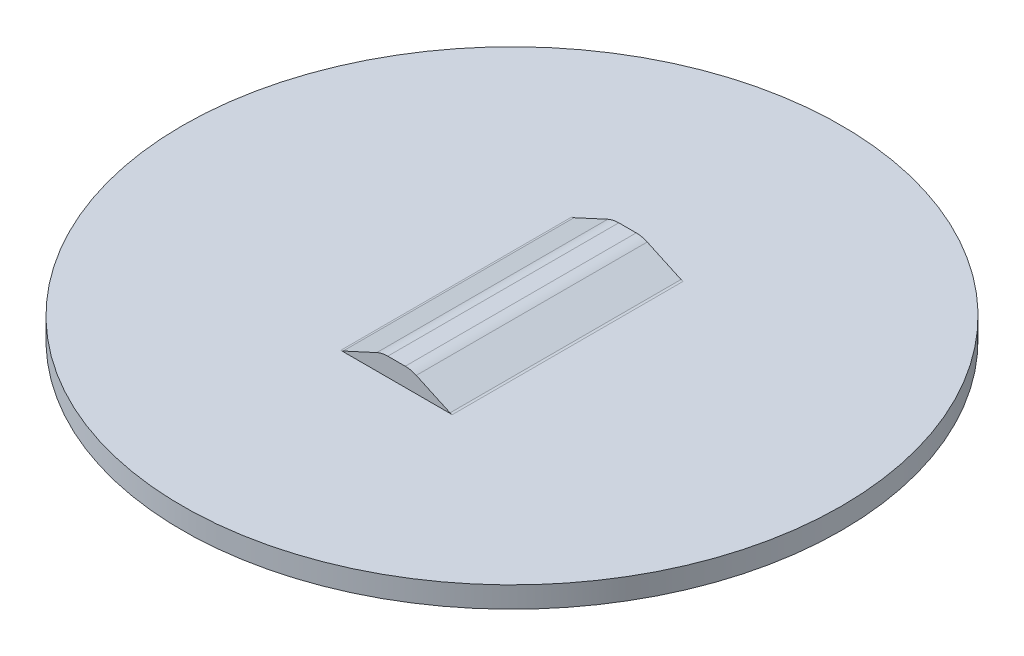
ISO-10303-21;
HEADER;
FILE_DESCRIPTION(('STEP AP214'),'2;1');
FILE_NAME('part.step','',(''),(''),'','','');
FILE_SCHEMA(('AUTOMOTIVE_DESIGN { 1 0 10303 214 1 1 1 1 }'));
ENDSEC;
DATA;
#1=APPLICATION_CONTEXT('core data for automotive mechanical design processes');
#2=APPLICATION_PROTOCOL_DEFINITION('international standard','automotive_design',2000,#1);
#3=PRODUCT_CONTEXT('',#1,'mechanical');
#4=PRODUCT('Part','Part','',(#3));
#5=PRODUCT_RELATED_PRODUCT_CATEGORY('part','',(#4));
#6=PRODUCT_DEFINITION_FORMATION('','',#4);
#7=PRODUCT_DEFINITION_CONTEXT('part definition',#1,'design');
#8=PRODUCT_DEFINITION('design','',#6,#7);
#9=PRODUCT_DEFINITION_SHAPE('','',#8);
#10=(LENGTH_UNIT() NAMED_UNIT(*) SI_UNIT(.MILLI.,.METRE.));
#11=(NAMED_UNIT(*) PLANE_ANGLE_UNIT() SI_UNIT($,.RADIAN.));
#12=(NAMED_UNIT(*) SI_UNIT($,.STERADIAN.) SOLID_ANGLE_UNIT());
#13=UNCERTAINTY_MEASURE_WITH_UNIT(LENGTH_MEASURE(1.E-05),#10,'distance_accuracy_value','');
#14=(GEOMETRIC_REPRESENTATION_CONTEXT(3) GLOBAL_UNCERTAINTY_ASSIGNED_CONTEXT((#13)) GLOBAL_UNIT_ASSIGNED_CONTEXT((#10,
#11,#12)) REPRESENTATION_CONTEXT('',''));
#15=CARTESIAN_POINT('',(0.,0.,0.));
#16=DIRECTION('',(0.,0.,1.));
#17=DIRECTION('',(1.,0.,0.));
#18=AXIS2_PLACEMENT_3D('',#15,#16,#17);
#19=CARTESIAN_POINT('',(0.420116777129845,-0.381,11.1252));
#20=DIRECTION('',(0.,0.,-1.));
#21=DIRECTION('',(-1.,0.,0.));
#22=AXIS2_PLACEMENT_3D('',#19,#20,#21);
#23=CYLINDRICAL_SURFACE('',#22,1.27);
#24=CARTESIAN_POINT('',(0.420116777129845,-0.381,11.1252));
#25=DIRECTION('',(0.,0.,-1.));
#26=DIRECTION('',(-1.,0.,0.));
#27=AXIS2_PLACEMENT_3D('',#24,#25,#26);
#28=CIRCLE('',#27,1.27);
#29=CARTESIAN_POINT('',(0.951357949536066,0.772552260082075,11.1252));
#30=VERTEX_POINT('',#29);
#31=CARTESIAN_POINT('',(0.420116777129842,0.889,11.1252));
#32=VERTEX_POINT('',#31);
#33=EDGE_CURVE('E198',#30,#32,#28,.F.);
#34=ORIENTED_EDGE('',*,*,#33,.F.);
#35=DIRECTION('',(0.,0.,1.));
#36=VECTOR('',#35,1.);
#37=CARTESIAN_POINT('',(0.951357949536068,0.772552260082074,11.1252));
#38=LINE('',#37,#36);
#39=CARTESIAN_POINT('',(0.951357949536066,0.772552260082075,0.));
#40=VERTEX_POINT('',#39);
#41=EDGE_CURVE('E113',#30,#40,#38,.F.);
#42=ORIENTED_EDGE('',*,*,#41,.T.);
#43=CARTESIAN_POINT('',(0.420116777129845,-0.381,0.));
#44=DIRECTION('',(0.,0.,-1.));
#45=DIRECTION('',(-1.,0.,0.));
#46=AXIS2_PLACEMENT_3D('',#43,#44,#45);
#47=CIRCLE('',#46,1.27);
#48=CARTESIAN_POINT('',(0.420116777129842,0.889,0.));
#49=VERTEX_POINT('',#48);
#50=EDGE_CURVE('E21',#40,#49,#47,.F.);
#51=ORIENTED_EDGE('',*,*,#50,.T.);
#52=DIRECTION('',(0.,0.,1.));
#53=VECTOR('',#52,1.);
#54=CARTESIAN_POINT('',(0.420116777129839,0.889,11.1252));
#55=LINE('',#54,#53);
#56=EDGE_CURVE('E117',#49,#32,#55,.T.);
#57=ORIENTED_EDGE('',*,*,#56,.T.);
#58=EDGE_LOOP('',(#34,#42,#51,#57));
#59=FACE_BOUND('',#58,.T.);
#60=ADVANCED_FACE('F18',(#59),#23,.T.);
#61=CARTESIAN_POINT('',(-0.42011677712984,0.889,11.1252));
#62=DIRECTION('',(0.,-1.,0.));
#63=DIRECTION('',(1.,0.,0.));
#64=AXIS2_PLACEMENT_3D('',#61,#62,#63);
#65=PLANE('',#64);
#66=DIRECTION('',(0.,0.,-1.));
#67=VECTOR('',#66,1.);
#68=CARTESIAN_POINT('',(-0.42011677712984,0.889,11.1252));
#69=LINE('',#68,#67);
#70=CARTESIAN_POINT('',(-0.420116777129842,0.889,11.1252));
#71=VERTEX_POINT('',#70);
#72=CARTESIAN_POINT('',(-0.420116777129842,0.889,0.));
#73=VERTEX_POINT('',#72);
#74=EDGE_CURVE('E130',#71,#73,#69,.T.);
#75=ORIENTED_EDGE('',*,*,#74,.F.);
#76=DIRECTION('',(1.,0.,0.));
#77=VECTOR('',#76,1.);
#78=CARTESIAN_POINT('',(-0.951357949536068,0.889,11.1252));
#79=LINE('',#78,#77);
#80=EDGE_CURVE('E128',#32,#71,#79,.F.);
#81=ORIENTED_EDGE('',*,*,#80,.F.);
#82=ORIENTED_EDGE('',*,*,#56,.F.);
#83=DIRECTION('',(1.,0.,0.));
#84=VECTOR('',#83,1.);
#85=CARTESIAN_POINT('',(-2.68457664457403,0.889,0.));
#86=LINE('',#85,#84);
#87=EDGE_CURVE('E122',#49,#73,#86,.F.);
#88=ORIENTED_EDGE('',*,*,#87,.T.);
#89=EDGE_LOOP('',(#75,#81,#82,#88));
#90=FACE_BOUND('',#89,.T.);
#91=ADVANCED_FACE('F125',(#90),#65,.F.);
#92=CARTESIAN_POINT('',(-0.420116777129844,-0.381,11.1252));
#93=DIRECTION('',(0.,0.,-1.));
#94=DIRECTION('',(-1.,0.,0.));
#95=AXIS2_PLACEMENT_3D('',#92,#93,#94);
#96=CYLINDRICAL_SURFACE('',#95,1.27);
#97=CARTESIAN_POINT('',(-0.420116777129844,-0.381,11.1252));
#98=DIRECTION('',(0.,0.,-1.));
#99=DIRECTION('',(-1.,0.,0.));
#100=AXIS2_PLACEMENT_3D('',#97,#98,#99);
#101=CIRCLE('',#100,1.27);
#102=CARTESIAN_POINT('',(-0.951357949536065,0.772552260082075,11.1252));
#103=VERTEX_POINT('',#102);
#104=EDGE_CURVE('E195',#71,#103,#101,.F.);
#105=ORIENTED_EDGE('',*,*,#104,.F.);
#106=ORIENTED_EDGE('',*,*,#74,.T.);
#107=CARTESIAN_POINT('',(-0.420116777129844,-0.381,0.));
#108=DIRECTION('',(0.,0.,-1.));
#109=DIRECTION('',(-1.,0.,0.));
#110=AXIS2_PLACEMENT_3D('',#107,#108,#109);
#111=CIRCLE('',#110,1.27);
#112=CARTESIAN_POINT('',(-0.951357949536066,0.772552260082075,0.));
#113=VERTEX_POINT('',#112);
#114=EDGE_CURVE('E136',#73,#113,#111,.F.);
#115=ORIENTED_EDGE('',*,*,#114,.T.);
#116=DIRECTION('',(0.,0.,1.));
#117=VECTOR('',#116,1.);
#118=CARTESIAN_POINT('',(-0.951357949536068,0.772552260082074,11.1252));
#119=LINE('',#118,#117);
#120=EDGE_CURVE('E150',#113,#103,#119,.T.);
#121=ORIENTED_EDGE('',*,*,#120,.T.);
#122=EDGE_LOOP('',(#105,#106,#115,#121));
#123=FACE_BOUND('',#122,.T.);
#124=ADVANCED_FACE('F266',(#123),#96,.T.);
#125=CARTESIAN_POINT('',(-0.951357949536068,0.772552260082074,11.1252));
#126=DIRECTION('',(0.418300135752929,-0.908308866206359,0.));
#127=DIRECTION('',(0.908308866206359,0.418300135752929,0.));
#128=AXIS2_PLACEMENT_3D('',#125,#126,#127);
#129=PLANE('',#128);
#130=DIRECTION('',(0.,0.,-1.));
#131=VECTOR('',#130,1.);
#132=CARTESIAN_POINT('',(-2.57832841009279,0.0232895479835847,11.1252));
#133=LINE('',#132,#131);
#134=CARTESIAN_POINT('',(-2.57832841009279,0.0232895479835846,0.));
#135=VERTEX_POINT('',#134);
#136=CARTESIAN_POINT('',(-2.57832841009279,0.0232895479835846,11.1252));
#137=VERTEX_POINT('',#136);
#138=EDGE_CURVE('E147',#135,#137,#133,.F.);
#139=ORIENTED_EDGE('',*,*,#138,.T.);
#140=DIRECTION('',(-0.908308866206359,-0.418300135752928,0.));
#141=VECTOR('',#140,1.);
#142=CARTESIAN_POINT('',(-0.951357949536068,0.772552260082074,11.1252));
#143=LINE('',#142,#141);
#144=EDGE_CURVE('E194',#103,#137,#143,.T.);
#145=ORIENTED_EDGE('',*,*,#144,.F.);
#146=ORIENTED_EDGE('',*,*,#120,.F.);
#147=DIRECTION('',(-0.908308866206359,-0.418300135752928,0.));
#148=VECTOR('',#147,1.);
#149=CARTESIAN_POINT('',(-0.951357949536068,0.772552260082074,0.));
#150=LINE('',#149,#148);
#151=EDGE_CURVE('E138',#113,#135,#150,.T.);
#152=ORIENTED_EDGE('',*,*,#151,.T.);
#153=EDGE_LOOP('',(#139,#145,#146,#152));
#154=FACE_BOUND('',#153,.T.);
#155=ADVANCED_FACE('F244',(#154),#129,.F.);
#156=CARTESIAN_POINT('',(0.951357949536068,0.772552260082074,11.1252));
#157=DIRECTION('',(-0.418300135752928,-0.908308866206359,0.));
#158=DIRECTION('',(0.908308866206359,-0.418300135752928,0.));
#159=AXIS2_PLACEMENT_3D('',#156,#157,#158);
#160=PLANE('',#159);
#161=ORIENTED_EDGE('',*,*,#41,.F.);
#162=DIRECTION('',(-0.908308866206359,0.418300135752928,0.));
#163=VECTOR('',#162,1.);
#164=CARTESIAN_POINT('',(2.57832841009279,0.0232895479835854,11.1252));
#165=LINE('',#164,#163);
#166=CARTESIAN_POINT('',(2.57832841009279,0.0232895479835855,11.1252));
#167=VERTEX_POINT('',#166);
#168=EDGE_CURVE('E200',#167,#30,#165,.T.);
#169=ORIENTED_EDGE('',*,*,#168,.F.);
#170=DIRECTION('',(0.,0.,-1.));
#171=VECTOR('',#170,1.);
#172=CARTESIAN_POINT('',(2.57832841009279,0.0232895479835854,11.1252));
#173=LINE('',#172,#171);
#174=CARTESIAN_POINT('',(2.57832841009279,0.0232895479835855,0.));
#175=VERTEX_POINT('',#174);
#176=EDGE_CURVE('E143',#167,#175,#173,.T.);
#177=ORIENTED_EDGE('',*,*,#176,.T.);
#178=DIRECTION('',(-0.908308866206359,0.418300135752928,0.));
#179=VECTOR('',#178,1.);
#180=CARTESIAN_POINT('',(2.57832841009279,0.0232895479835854,0.));
#181=LINE('',#180,#179);
#182=EDGE_CURVE('E123',#175,#40,#181,.T.);
#183=ORIENTED_EDGE('',*,*,#182,.T.);
#184=EDGE_LOOP('',(#161,#169,#177,#183));
#185=FACE_BOUND('',#184,.T.);
#186=ADVANCED_FACE('F257',(#185),#160,.F.);
#187=CARTESIAN_POINT('',(-2.68457664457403,0.253999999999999,0.));
#188=DIRECTION('',(0.,0.,1.));
#189=DIRECTION('',(1.,0.,0.));
#190=AXIS2_PLACEMENT_3D('',#187,#188,#189);
#191=PLANE('',#190);
#192=CARTESIAN_POINT('',(-2.68457664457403,0.253999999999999,0.));
#193=DIRECTION('',(0.,0.,-1.));
#194=DIRECTION('',(-1.,0.,0.));
#195=AXIS2_PLACEMENT_3D('',#192,#193,#194);
#196=CIRCLE('',#195,0.253999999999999);
#197=CARTESIAN_POINT('',(-2.68457664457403,0.,0.));
#198=VERTEX_POINT('',#197);
#199=EDGE_CURVE('E149',#198,#135,#196,.F.);
#200=ORIENTED_EDGE('',*,*,#199,.T.);
#201=ORIENTED_EDGE('',*,*,#151,.F.);
#202=ORIENTED_EDGE('',*,*,#114,.F.);
#203=ORIENTED_EDGE('',*,*,#87,.F.);
#204=ORIENTED_EDGE('',*,*,#50,.F.);
#205=ORIENTED_EDGE('',*,*,#182,.F.);
#206=CARTESIAN_POINT('',(2.68457664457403,0.254000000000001,0.));
#207=DIRECTION('',(0.,0.,-1.));
#208=DIRECTION('',(-1.,0.,0.));
#209=AXIS2_PLACEMENT_3D('',#206,#207,#208);
#210=CIRCLE('',#209,0.254);
#211=CARTESIAN_POINT('',(2.68457664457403,0.,0.));
#212=VERTEX_POINT('',#211);
#213=EDGE_CURVE('E145',#175,#212,#210,.F.);
#214=ORIENTED_EDGE('',*,*,#213,.T.);
#215=DIRECTION('',(1.,0.,0.));
#216=VECTOR('',#215,1.);
#217=CARTESIAN_POINT('',(2.68457664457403,0.,0.));
#218=LINE('',#217,#216);
#219=EDGE_CURVE('E212',#212,#198,#218,.F.);
#220=ORIENTED_EDGE('',*,*,#219,.T.);
#221=EDGE_LOOP('',(#200,#201,#202,#203,#204,#205,#214,#220));
#222=FACE_BOUND('',#221,.T.);
#223=ADVANCED_FACE('F134',(#222),#191,.F.);
#224=CARTESIAN_POINT('',(-2.68457664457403,0.253999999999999,11.1252));
#225=DIRECTION('',(0.,0.,-1.));
#226=DIRECTION('',(-1.,0.,0.));
#227=AXIS2_PLACEMENT_3D('',#224,#225,#226);
#228=CYLINDRICAL_SURFACE('',#227,0.253999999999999);
#229=DIRECTION('',(0.,0.,1.));
#230=VECTOR('',#229,1.);
#231=CARTESIAN_POINT('',(-2.68457664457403,0.,11.1252));
#232=LINE('',#231,#230);
#233=CARTESIAN_POINT('',(-2.68457664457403,0.,11.1252));
#234=VERTEX_POINT('',#233);
#235=EDGE_CURVE('E209',#198,#234,#232,.T.);
#236=ORIENTED_EDGE('',*,*,#235,.T.);
#237=CARTESIAN_POINT('',(-2.68457664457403,0.253999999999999,11.1252));
#238=DIRECTION('',(0.,0.,-1.));
#239=DIRECTION('',(-1.,0.,0.));
#240=AXIS2_PLACEMENT_3D('',#237,#238,#239);
#241=CIRCLE('',#240,0.253999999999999);
#242=EDGE_CURVE('E191',#137,#234,#241,.T.);
#243=ORIENTED_EDGE('',*,*,#242,.F.);
#244=ORIENTED_EDGE('',*,*,#138,.F.);
#245=ORIENTED_EDGE('',*,*,#199,.F.);
#246=EDGE_LOOP('',(#236,#243,#244,#245));
#247=FACE_BOUND('',#246,.T.);
#248=ADVANCED_FACE('F246',(#247),#228,.F.);
#249=CARTESIAN_POINT('',(-0.951357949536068,0.772552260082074,11.1252));
#250=DIRECTION('',(0.,0.,1.));
#251=DIRECTION('',(1.,0.,0.));
#252=AXIS2_PLACEMENT_3D('',#249,#250,#251);
#253=PLANE('',#252);
#254=ORIENTED_EDGE('',*,*,#144,.T.);
#255=ORIENTED_EDGE('',*,*,#242,.T.);
#256=DIRECTION('',(1.,0.,0.));
#257=VECTOR('',#256,1.);
#258=CARTESIAN_POINT('',(2.68457664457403,0.,11.1252));
#259=LINE('',#258,#257);
#260=CARTESIAN_POINT('',(2.68457664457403,0.,11.1252));
#261=VERTEX_POINT('',#260);
#262=EDGE_CURVE('E211',#234,#261,#259,.T.);
#263=ORIENTED_EDGE('',*,*,#262,.T.);
#264=CARTESIAN_POINT('',(2.68457664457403,0.254000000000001,11.1252));
#265=DIRECTION('',(0.,0.,-1.));
#266=DIRECTION('',(-1.,0.,0.));
#267=AXIS2_PLACEMENT_3D('',#264,#265,#266);
#268=CIRCLE('',#267,0.254);
#269=EDGE_CURVE('E146',#261,#167,#268,.T.);
#270=ORIENTED_EDGE('',*,*,#269,.T.);
#271=ORIENTED_EDGE('',*,*,#168,.T.);
#272=ORIENTED_EDGE('',*,*,#33,.T.);
#273=ORIENTED_EDGE('',*,*,#80,.T.);
#274=ORIENTED_EDGE('',*,*,#104,.T.);
#275=EDGE_LOOP('',(#254,#255,#263,#270,#271,#272,#273,#274));
#276=FACE_BOUND('',#275,.T.);
#277=ADVANCED_FACE('F238',(#276),#253,.T.);
#278=CARTESIAN_POINT('',(2.68457664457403,0.254000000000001,11.1252));
#279=DIRECTION('',(0.,0.,-1.));
#280=DIRECTION('',(-1.,0.,0.));
#281=AXIS2_PLACEMENT_3D('',#278,#279,#280);
#282=CYLINDRICAL_SURFACE('',#281,0.254);
#283=ORIENTED_EDGE('',*,*,#176,.F.);
#284=ORIENTED_EDGE('',*,*,#269,.F.);
#285=DIRECTION('',(0.,0.,1.));
#286=VECTOR('',#285,1.);
#287=CARTESIAN_POINT('',(2.68457664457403,0.,11.1252));
#288=LINE('',#287,#286);
#289=EDGE_CURVE('E214',#261,#212,#288,.F.);
#290=ORIENTED_EDGE('',*,*,#289,.T.);
#291=ORIENTED_EDGE('',*,*,#213,.F.);
#292=EDGE_LOOP('',(#283,#284,#290,#291));
#293=FACE_BOUND('',#292,.T.);
#294=ADVANCED_FACE('F254',(#293),#282,.F.);
#295=CARTESIAN_POINT('',(-0.526365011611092,-0.150289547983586,11.1252));
#296=DIRECTION('',(0.418300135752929,-0.908308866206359,0.));
#297=DIRECTION('',(0.908308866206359,0.418300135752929,0.));
#298=AXIS2_PLACEMENT_3D('',#295,#296,#297);
#299=PLANE('',#298);
#300=DIRECTION('',(-0.908308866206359,-0.418300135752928,0.));
#301=VECTOR('',#300,1.);
#302=CARTESIAN_POINT('',(-0.526365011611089,-0.150289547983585,11.1252));
#303=LINE('',#302,#301);
#304=CARTESIAN_POINT('',(-0.526365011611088,-0.150289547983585,11.1252));
#305=VERTEX_POINT('',#304);
#306=CARTESIAN_POINT('',(-2.15333547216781,-0.899552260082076,11.1252));
#307=VERTEX_POINT('',#306);
#308=EDGE_CURVE('E170',#305,#307,#303,.T.);
#309=ORIENTED_EDGE('',*,*,#308,.T.);
#310=DIRECTION('',(0.,0.,-1.));
#311=VECTOR('',#310,1.);
#312=CARTESIAN_POINT('',(-2.15333547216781,-0.899552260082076,11.1252));
#313=LINE('',#312,#311);
#314=CARTESIAN_POINT('',(-2.15333547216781,-0.899552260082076,0.));
#315=VERTEX_POINT('',#314);
#316=EDGE_CURVE('E174',#315,#307,#313,.F.);
#317=ORIENTED_EDGE('',*,*,#316,.F.);
#318=DIRECTION('',(-0.908308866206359,-0.418300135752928,0.));
#319=VECTOR('',#318,1.);
#320=CARTESIAN_POINT('',(-0.526365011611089,-0.150289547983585,0.));
#321=LINE('',#320,#319);
#322=CARTESIAN_POINT('',(-0.526365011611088,-0.150289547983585,0.));
#323=VERTEX_POINT('',#322);
#324=EDGE_CURVE('E178',#323,#315,#321,.T.);
#325=ORIENTED_EDGE('',*,*,#324,.F.);
#326=DIRECTION('',(0.,0.,-1.));
#327=VECTOR('',#326,1.);
#328=CARTESIAN_POINT('',(-0.526365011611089,-0.150289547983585,11.1252));
#329=LINE('',#328,#327);
#330=EDGE_CURVE('E219',#323,#305,#329,.F.);
#331=ORIENTED_EDGE('',*,*,#330,.T.);
#332=EDGE_LOOP('',(#309,#317,#325,#331));
#333=FACE_BOUND('',#332,.T.);
#334=ADVANCED_FACE('F312',(#333),#299,.T.);
#335=CARTESIAN_POINT('',(0.526365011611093,-0.150289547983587,11.1252));
#336=DIRECTION('',(-0.418300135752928,-0.908308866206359,0.));
#337=DIRECTION('',(0.908308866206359,-0.418300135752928,0.));
#338=AXIS2_PLACEMENT_3D('',#335,#336,#337);
#339=PLANE('',#338);
#340=DIRECTION('',(-0.908308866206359,0.418300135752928,0.));
#341=VECTOR('',#340,1.);
#342=CARTESIAN_POINT('',(2.15333547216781,-0.899552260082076,11.1252));
#343=LINE('',#342,#341);
#344=CARTESIAN_POINT('',(2.15333547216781,-0.899552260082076,11.1252));
#345=VERTEX_POINT('',#344);
#346=CARTESIAN_POINT('',(0.52636501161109,-0.150289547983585,11.1252));
#347=VERTEX_POINT('',#346);
#348=EDGE_CURVE('E165',#345,#347,#343,.T.);
#349=ORIENTED_EDGE('',*,*,#348,.T.);
#350=DIRECTION('',(0.,0.,-1.));
#351=VECTOR('',#350,1.);
#352=CARTESIAN_POINT('',(0.526365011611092,-0.150289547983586,11.1252));
#353=LINE('',#352,#351);
#354=CARTESIAN_POINT('',(0.52636501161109,-0.150289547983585,0.));
#355=VERTEX_POINT('',#354);
#356=EDGE_CURVE('E188',#347,#355,#353,.T.);
#357=ORIENTED_EDGE('',*,*,#356,.T.);
#358=DIRECTION('',(-0.908308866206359,0.418300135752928,0.));
#359=VECTOR('',#358,1.);
#360=CARTESIAN_POINT('',(2.15333547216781,-0.899552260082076,0.));
#361=LINE('',#360,#359);
#362=CARTESIAN_POINT('',(2.15333547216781,-0.899552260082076,0.));
#363=VERTEX_POINT('',#362);
#364=EDGE_CURVE('E186',#363,#355,#361,.T.);
#365=ORIENTED_EDGE('',*,*,#364,.F.);
#366=DIRECTION('',(0.,0.,-1.));
#367=VECTOR('',#366,1.);
#368=CARTESIAN_POINT('',(2.15333547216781,-0.899552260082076,11.1252));
#369=LINE('',#368,#367);
#370=EDGE_CURVE('E216',#345,#363,#369,.T.);
#371=ORIENTED_EDGE('',*,*,#370,.F.);
#372=EDGE_LOOP('',(#349,#357,#365,#371));
#373=FACE_BOUND('',#372,.T.);
#374=ADVANCED_FACE('F308',(#373),#339,.T.);
#375=CARTESIAN_POINT('',(0.420116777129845,-0.381,11.1252));
#376=DIRECTION('',(0.,0.,-1.));
#377=DIRECTION('',(-1.,0.,0.));
#378=AXIS2_PLACEMENT_3D('',#375,#376,#377);
#379=CYLINDRICAL_SURFACE('',#378,0.254);
#380=ORIENTED_EDGE('',*,*,#356,.F.);
#381=CARTESIAN_POINT('',(0.420116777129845,-0.381,11.1252));
#382=DIRECTION('',(0.,0.,-1.));
#383=DIRECTION('',(-1.,0.,0.));
#384=AXIS2_PLACEMENT_3D('',#381,#382,#383);
#385=CIRCLE('',#384,0.254);
#386=CARTESIAN_POINT('',(0.420116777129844,-0.127,11.1252));
#387=VERTEX_POINT('',#386);
#388=EDGE_CURVE('E162',#347,#387,#385,.F.);
#389=ORIENTED_EDGE('',*,*,#388,.T.);
#390=DIRECTION('',(0.,0.,1.));
#391=VECTOR('',#390,1.);
#392=CARTESIAN_POINT('',(0.420116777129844,-0.127,11.1252));
#393=LINE('',#392,#391);
#394=CARTESIAN_POINT('',(0.420116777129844,-0.127,0.));
#395=VERTEX_POINT('',#394);
#396=EDGE_CURVE('E227',#395,#387,#393,.T.);
#397=ORIENTED_EDGE('',*,*,#396,.F.);
#398=CARTESIAN_POINT('',(0.420116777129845,-0.381,0.));
#399=DIRECTION('',(0.,0.,-1.));
#400=DIRECTION('',(-1.,0.,0.));
#401=AXIS2_PLACEMENT_3D('',#398,#399,#400);
#402=CIRCLE('',#401,0.254);
#403=EDGE_CURVE('E183',#355,#395,#402,.F.);
#404=ORIENTED_EDGE('',*,*,#403,.F.);
#405=EDGE_LOOP('',(#380,#389,#397,#404));
#406=FACE_BOUND('',#405,.T.);
#407=ADVANCED_FACE('F305',(#406),#379,.F.);
#408=CARTESIAN_POINT('',(-0.42011677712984,-0.127,11.1252));
#409=DIRECTION('',(0.,-1.,0.));
#410=DIRECTION('',(1.,0.,0.));
#411=AXIS2_PLACEMENT_3D('',#408,#409,#410);
#412=PLANE('',#411);
#413=DIRECTION('',(1.,0.,0.));
#414=VECTOR('',#413,1.);
#415=CARTESIAN_POINT('',(2.68457664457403,-0.127,11.1252));
#416=LINE('',#415,#414);
#417=CARTESIAN_POINT('',(-0.420116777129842,-0.127,11.1252));
#418=VERTEX_POINT('',#417);
#419=EDGE_CURVE('E161',#387,#418,#416,.F.);
#420=ORIENTED_EDGE('',*,*,#419,.T.);
#421=DIRECTION('',(0.,0.,-1.));
#422=VECTOR('',#421,1.);
#423=CARTESIAN_POINT('',(-0.42011677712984,-0.127,11.1252));
#424=LINE('',#423,#422);
#425=CARTESIAN_POINT('',(-0.420116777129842,-0.127,0.));
#426=VERTEX_POINT('',#425);
#427=EDGE_CURVE('E217',#418,#426,#424,.T.);
#428=ORIENTED_EDGE('',*,*,#427,.T.);
#429=DIRECTION('',(1.,0.,0.));
#430=VECTOR('',#429,1.);
#431=CARTESIAN_POINT('',(2.68457664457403,-0.127,0.));
#432=LINE('',#431,#430);
#433=EDGE_CURVE('E182',#395,#426,#432,.F.);
#434=ORIENTED_EDGE('',*,*,#433,.F.);
#435=ORIENTED_EDGE('',*,*,#396,.T.);
#436=EDGE_LOOP('',(#420,#428,#434,#435));
#437=FACE_BOUND('',#436,.T.);
#438=ADVANCED_FACE('F301',(#437),#412,.T.);
#439=CARTESIAN_POINT('',(-0.420116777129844,-0.381,11.1252));
#440=DIRECTION('',(0.,0.,-1.));
#441=DIRECTION('',(-1.,0.,0.));
#442=AXIS2_PLACEMENT_3D('',#439,#440,#441);
#443=CYLINDRICAL_SURFACE('',#442,0.254);
#444=ORIENTED_EDGE('',*,*,#427,.F.);
#445=CARTESIAN_POINT('',(-0.420116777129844,-0.381,11.1252));
#446=DIRECTION('',(0.,0.,-1.));
#447=DIRECTION('',(-1.,0.,0.));
#448=AXIS2_PLACEMENT_3D('',#445,#446,#447);
#449=CIRCLE('',#448,0.254);
#450=EDGE_CURVE('E158',#418,#305,#449,.F.);
#451=ORIENTED_EDGE('',*,*,#450,.T.);
#452=ORIENTED_EDGE('',*,*,#330,.F.);
#453=CARTESIAN_POINT('',(-0.420116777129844,-0.381,0.));
#454=DIRECTION('',(0.,0.,-1.));
#455=DIRECTION('',(-1.,0.,0.));
#456=AXIS2_PLACEMENT_3D('',#453,#454,#455);
#457=CIRCLE('',#456,0.254);
#458=EDGE_CURVE('E179',#426,#323,#457,.F.);
#459=ORIENTED_EDGE('',*,*,#458,.F.);
#460=EDGE_LOOP('',(#444,#451,#452,#459));
#461=FACE_BOUND('',#460,.T.);
#462=ADVANCED_FACE('F297',(#461),#443,.F.);
#463=CARTESIAN_POINT('',(2.68457664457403,0.,11.1252));
#464=DIRECTION('',(0.,-1.,0.));
#465=DIRECTION('',(1.,0.,0.));
#466=AXIS2_PLACEMENT_3D('',#463,#464,#465);
#467=PLANE('',#466);
#468=CARTESIAN_POINT('',(0.,0.,5.5626));
#469=DIRECTION('',(0.,-1.,0.));
#470=DIRECTION('',(1.,0.,0.));
#471=AXIS2_PLACEMENT_3D('',#468,#469,#470);
#472=CIRCLE('',#471,15.875);
#473=CARTESIAN_POINT('',(15.875,0.,5.5626));
#474=VERTEX_POINT('',#473);
#475=EDGE_CURVE('E154',#474,#474,#472,.T.);
#476=ORIENTED_EDGE('',*,*,#475,.F.);
#477=EDGE_LOOP('',(#476));
#478=FACE_BOUND('',#477,.T.);
#479=ORIENTED_EDGE('',*,*,#262,.F.);
#480=ORIENTED_EDGE('',*,*,#235,.F.);
#481=ORIENTED_EDGE('',*,*,#219,.F.);
#482=ORIENTED_EDGE('',*,*,#289,.F.);
#483=EDGE_LOOP('',(#479,#480,#481,#482));
#484=FACE_BOUND('',#483,.T.);
#485=ADVANCED_FACE('F249',(#478,#484),#467,.F.);
#486=CARTESIAN_POINT('',(2.68457664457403,0.254000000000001,11.1252));
#487=DIRECTION('',(0.,0.,-1.));
#488=DIRECTION('',(-1.,0.,0.));
#489=AXIS2_PLACEMENT_3D('',#486,#487,#488);
#490=CYLINDRICAL_SURFACE('',#489,1.27);
#491=CARTESIAN_POINT('',(2.68457664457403,0.254000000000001,11.1252));
#492=DIRECTION('',(0.,0.,-1.));
#493=DIRECTION('',(-1.,0.,0.));
#494=AXIS2_PLACEMENT_3D('',#491,#492,#493);
#495=CIRCLE('',#494,1.27);
#496=CARTESIAN_POINT('',(2.68457664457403,-1.016,11.1252));
#497=VERTEX_POINT('',#496);
#498=EDGE_CURVE('E166',#497,#345,#495,.T.);
#499=ORIENTED_EDGE('',*,*,#498,.T.);
#500=ORIENTED_EDGE('',*,*,#370,.T.);
#501=CARTESIAN_POINT('',(2.68457664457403,0.254000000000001,0.));
#502=DIRECTION('',(0.,0.,-1.));
#503=DIRECTION('',(-1.,0.,0.));
#504=AXIS2_PLACEMENT_3D('',#501,#502,#503);
#505=CIRCLE('',#504,1.27);
#506=CARTESIAN_POINT('',(2.68457664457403,-1.016,0.));
#507=VERTEX_POINT('',#506);
#508=EDGE_CURVE('E175',#507,#363,#505,.T.);
#509=ORIENTED_EDGE('',*,*,#508,.F.);
#510=DIRECTION('',(0.,0.,1.));
#511=VECTOR('',#510,1.);
#512=CARTESIAN_POINT('',(2.68457664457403,-1.016,11.1252));
#513=LINE('',#512,#511);
#514=EDGE_CURVE('E157',#497,#507,#513,.F.);
#515=ORIENTED_EDGE('',*,*,#514,.F.);
#516=EDGE_LOOP('',(#499,#500,#509,#515));
#517=FACE_BOUND('',#516,.T.);
#518=ADVANCED_FACE('F290',(#517),#490,.T.);
#519=CARTESIAN_POINT('',(2.68457664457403,0.,0.));
#520=DIRECTION('',(0.,0.,1.));
#521=DIRECTION('',(1.,0.,0.));
#522=AXIS2_PLACEMENT_3D('',#519,#520,#521);
#523=PLANE('',#522);
#524=DIRECTION('',(1.,0.,0.));
#525=VECTOR('',#524,1.);
#526=CARTESIAN_POINT('',(2.68457664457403,-1.016,0.));
#527=LINE('',#526,#525);
#528=CARTESIAN_POINT('',(-2.68457664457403,-1.016,0.));
#529=VERTEX_POINT('',#528);
#530=EDGE_CURVE('E476',#507,#529,#527,.F.);
#531=ORIENTED_EDGE('',*,*,#530,.F.);
#532=ORIENTED_EDGE('',*,*,#508,.T.);
#533=ORIENTED_EDGE('',*,*,#364,.T.);
#534=ORIENTED_EDGE('',*,*,#403,.T.);
#535=ORIENTED_EDGE('',*,*,#433,.T.);
#536=ORIENTED_EDGE('',*,*,#458,.T.);
#537=ORIENTED_EDGE('',*,*,#324,.T.);
#538=CARTESIAN_POINT('',(-2.68457664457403,0.253999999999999,0.));
#539=DIRECTION('',(0.,0.,-1.));
#540=DIRECTION('',(-1.,0.,0.));
#541=AXIS2_PLACEMENT_3D('',#538,#539,#540);
#542=CIRCLE('',#541,1.27);
#543=EDGE_CURVE('E171',#529,#315,#542,.F.);
#544=ORIENTED_EDGE('',*,*,#543,.F.);
#545=EDGE_LOOP('',(#531,#532,#533,#534,#535,#536,#537,#544));
#546=FACE_BOUND('',#545,.T.);
#547=ADVANCED_FACE('F287',(#546),#523,.T.);
#548=CARTESIAN_POINT('',(-2.68457664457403,0.253999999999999,11.1252));
#549=DIRECTION('',(0.,0.,-1.));
#550=DIRECTION('',(-1.,0.,0.));
#551=AXIS2_PLACEMENT_3D('',#548,#549,#550);
#552=CYLINDRICAL_SURFACE('',#551,1.27);
#553=CARTESIAN_POINT('',(-2.68457664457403,0.253999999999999,11.1252));
#554=DIRECTION('',(0.,0.,-1.));
#555=DIRECTION('',(-1.,0.,0.));
#556=AXIS2_PLACEMENT_3D('',#553,#554,#555);
#557=CIRCLE('',#556,1.27);
#558=CARTESIAN_POINT('',(-2.68457664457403,-1.016,11.1252));
#559=VERTEX_POINT('',#558);
#560=EDGE_CURVE('E36',#307,#559,#557,.T.);
#561=ORIENTED_EDGE('',*,*,#560,.T.);
#562=DIRECTION('',(0.,0.,1.));
#563=VECTOR('',#562,1.);
#564=CARTESIAN_POINT('',(-2.68457664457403,-1.016,11.1252));
#565=LINE('',#564,#563);
#566=EDGE_CURVE('E472',#529,#559,#565,.T.);
#567=ORIENTED_EDGE('',*,*,#566,.F.);
#568=ORIENTED_EDGE('',*,*,#543,.T.);
#569=ORIENTED_EDGE('',*,*,#316,.T.);
#570=EDGE_LOOP('',(#561,#567,#568,#569));
#571=FACE_BOUND('',#570,.T.);
#572=ADVANCED_FACE('F283',(#571),#552,.T.);
#573=CARTESIAN_POINT('',(2.68457664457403,0.,11.1252));
#574=DIRECTION('',(0.,0.,1.));
#575=DIRECTION('',(1.,0.,0.));
#576=AXIS2_PLACEMENT_3D('',#573,#574,#575);
#577=PLANE('',#576);
#578=ORIENTED_EDGE('',*,*,#419,.F.);
#579=ORIENTED_EDGE('',*,*,#388,.F.);
#580=ORIENTED_EDGE('',*,*,#348,.F.);
#581=ORIENTED_EDGE('',*,*,#498,.F.);
#582=DIRECTION('',(1.,0.,0.));
#583=VECTOR('',#582,1.);
#584=CARTESIAN_POINT('',(2.68457664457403,-1.016,11.1252));
#585=LINE('',#584,#583);
#586=EDGE_CURVE('E27',#559,#497,#585,.T.);
#587=ORIENTED_EDGE('',*,*,#586,.F.);
#588=ORIENTED_EDGE('',*,*,#560,.F.);
#589=ORIENTED_EDGE('',*,*,#308,.F.);
#590=ORIENTED_EDGE('',*,*,#450,.F.);
#591=EDGE_LOOP('',(#578,#579,#580,#581,#587,#588,#589,#590));
#592=FACE_BOUND('',#591,.T.);
#593=ADVANCED_FACE('F276',(#592),#577,.F.);
#594=CARTESIAN_POINT('',(0.,0.,5.5626));
#595=DIRECTION('',(0.,-1.,0.));
#596=DIRECTION('',(1.,0.,0.));
#597=AXIS2_PLACEMENT_3D('',#594,#595,#596);
#598=CYLINDRICAL_SURFACE('',#597,15.875);
#599=ORIENTED_EDGE('',*,*,#475,.T.);
#600=EDGE_LOOP('',(#599));
#601=FACE_BOUND('',#600,.T.);
#602=CARTESIAN_POINT('',(0.,-1.016,5.5626));
#603=DIRECTION('',(0.,-1.,0.));
#604=DIRECTION('',(1.,0.,0.));
#605=AXIS2_PLACEMENT_3D('',#602,#603,#604);
#606=CIRCLE('',#605,15.875);
#607=CARTESIAN_POINT('',(15.875,-1.01600000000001,5.5626));
#608=VERTEX_POINT('',#607);
#609=EDGE_CURVE('E11',#608,#608,#606,.T.);
#610=ORIENTED_EDGE('',*,*,#609,.F.);
#611=EDGE_LOOP('',(#610));
#612=FACE_BOUND('',#611,.T.);
#613=ADVANCED_FACE('F270',(#601,#612),#598,.T.);
#614=CARTESIAN_POINT('',(2.68457664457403,-1.016,11.1252));
#615=DIRECTION('',(0.,-1.,0.));
#616=DIRECTION('',(1.,0.,0.));
#617=AXIS2_PLACEMENT_3D('',#614,#615,#616);
#618=PLANE('',#617);
#619=ORIENTED_EDGE('',*,*,#609,.T.);
#620=EDGE_LOOP('',(#619));
#621=FACE_BOUND('',#620,.T.);
#622=ORIENTED_EDGE('',*,*,#566,.T.);
#623=ORIENTED_EDGE('',*,*,#586,.T.);
#624=ORIENTED_EDGE('',*,*,#514,.T.);
#625=ORIENTED_EDGE('',*,*,#530,.T.);
#626=EDGE_LOOP('',(#622,#623,#624,#625));
#627=FACE_BOUND('',#626,.T.);
#628=ADVANCED_FACE('F268',(#621,#627),#618,.T.);
#629=CLOSED_SHELL('',(#60,#91,#124,#155,#186,#223,#248,#277,#294,#334,#374,#407,#438,#462,#485,
#518,#547,#572,#593,#613,#628));
#630=MANIFOLD_SOLID_BREP('B1',#629);
#631=ADVANCED_BREP_SHAPE_REPRESENTATION('',(#18,#630),#14);
#632=SHAPE_DEFINITION_REPRESENTATION(#9,#631);
ENDSEC;
END-ISO-10303-21;
